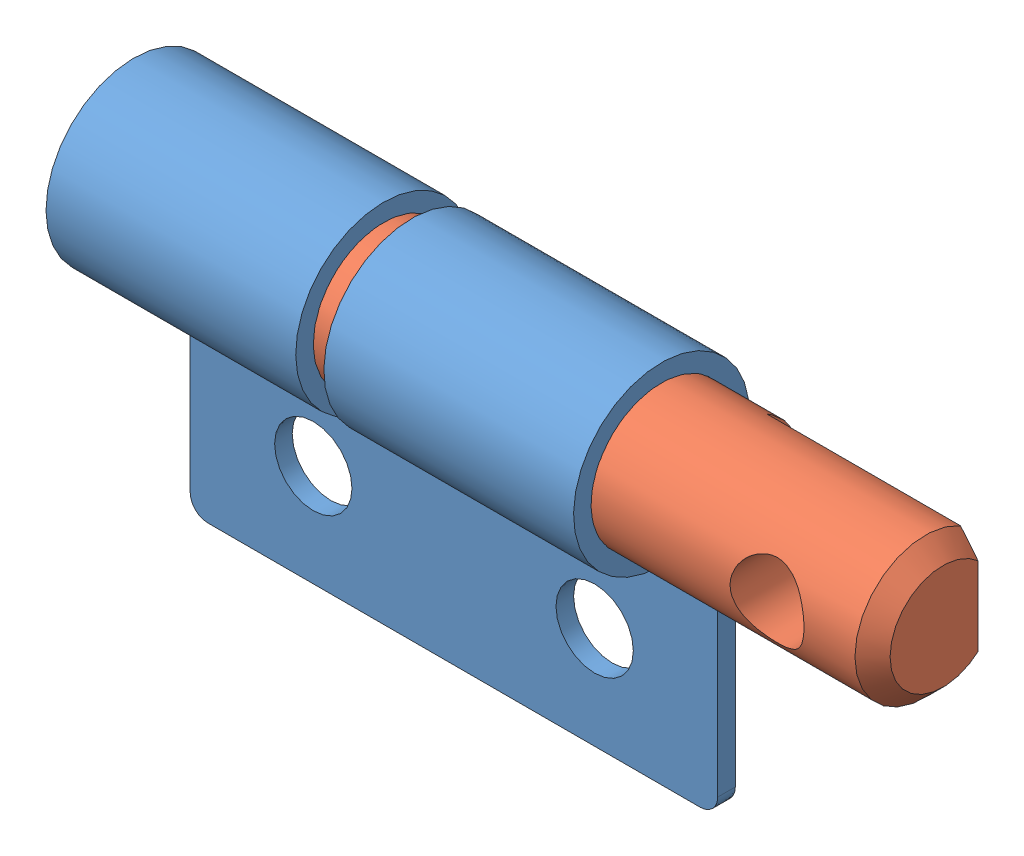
SolidWorks assembly ST015A0.SLDASM, configuration Default (file format 7000). Lengths in mm.
Overall size (23 12 5).
2 component instances, 2 part files, 3 mates.
Components (placement in the parent):
- ST015A BRACKET-1: ST015A BRACKET.SLDPRT [Default] at (7.5 0 0) size (15.03 12 5)
- ST015A1 Shaft-2: ST015A1 Shaft.SLDPRT [ST025] x (1 0 0) z (0 0 -1) size (23 4 4)
Mates (geometry in assembly coordinates):
- Coincident1: coincident: plane of ST015A BRACKET-1 through (0 -1.3565 -2.1) normal (-1 0 0); plane of ST015A1 Shaft-2 through (0 0 0) normal (-1 0 0)
- Concentric1: concentric: cylinder of ST015A BRACKET-1 through (15 0 0) axis (-1 0 0) radius 2; cylinder of ST015A1 Shaft-2 through (0 0 0) axis (-1 0 0) radius 2
- Parallel1: parallel aligned: plane of ST015A BRACKET-1 through (15 -2.5 -2.1) normal (0 0 -1); plane of ST015A1 Shaft-2 through (17 -1.7321 -1) normal (0 0 -1)
